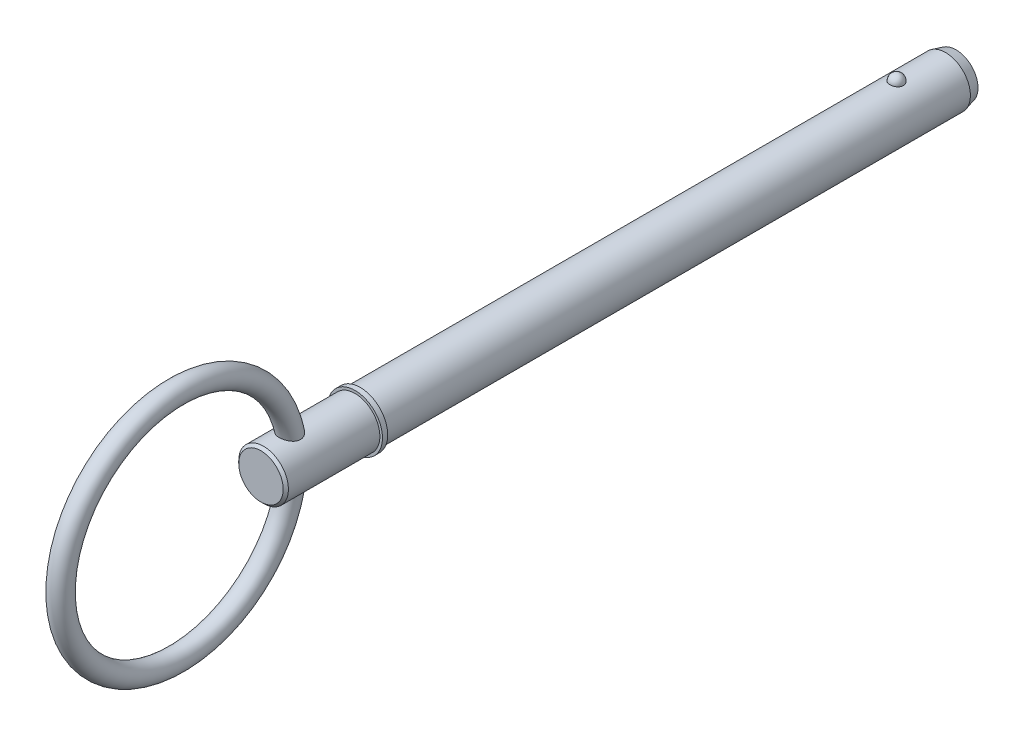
ISO-10303-21;
HEADER;
FILE_DESCRIPTION(('STEP AP214'),'2;1');
FILE_NAME('part.step','',(''),(''),'','','');
FILE_SCHEMA(('AUTOMOTIVE_DESIGN { 1 0 10303 214 1 1 1 1 }'));
ENDSEC;
DATA;
#1=APPLICATION_CONTEXT('core data for automotive mechanical design processes');
#2=APPLICATION_PROTOCOL_DEFINITION('international standard','automotive_design',2000,#1);
#3=PRODUCT_CONTEXT('',#1,'mechanical');
#4=PRODUCT('Part','Part','',(#3));
#5=PRODUCT_RELATED_PRODUCT_CATEGORY('part','',(#4));
#6=PRODUCT_DEFINITION_FORMATION('','',#4);
#7=PRODUCT_DEFINITION_CONTEXT('part definition',#1,'design');
#8=PRODUCT_DEFINITION('design','',#6,#7);
#9=PRODUCT_DEFINITION_SHAPE('','',#8);
#10=(LENGTH_UNIT() NAMED_UNIT(*) SI_UNIT(.MILLI.,.METRE.));
#11=(NAMED_UNIT(*) PLANE_ANGLE_UNIT() SI_UNIT($,.RADIAN.));
#12=(NAMED_UNIT(*) SI_UNIT($,.STERADIAN.) SOLID_ANGLE_UNIT());
#13=UNCERTAINTY_MEASURE_WITH_UNIT(LENGTH_MEASURE(1.E-05),#10,'distance_accuracy_value','');
#14=(GEOMETRIC_REPRESENTATION_CONTEXT(3) GLOBAL_UNCERTAINTY_ASSIGNED_CONTEXT((#13)) GLOBAL_UNIT_ASSIGNED_CONTEXT((#10,
#11,#12)) REPRESENTATION_CONTEXT('',''));
#15=CARTESIAN_POINT('',(0.,0.,0.));
#16=DIRECTION('',(0.,0.,1.));
#17=DIRECTION('',(1.,0.,0.));
#18=AXIS2_PLACEMENT_3D('',#15,#16,#17);
#19=CARTESIAN_POINT('',(0.,0.,101.6));
#20=DIRECTION('',(0.,0.,-1.));
#21=DIRECTION('',(-1.,0.,0.));
#22=AXIS2_PLACEMENT_3D('',#19,#20,#21);
#23=CYLINDRICAL_SURFACE('',#22,4.765);
#24=CARTESIAN_POINT('',(1.27812710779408,4.59038300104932,-1.29));
#25=CARTESIAN_POINT('',(1.27812572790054,4.59038414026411,-1.2178688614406));
#26=CARTESIAN_POINT('',(1.27223018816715,4.59203736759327,-1.14572000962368));
#27=CARTESIAN_POINT('',(1.24878929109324,4.59846646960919,-1.00346315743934));
#28=CARTESIAN_POINT('',(1.23123896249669,4.60324367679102,-0.933356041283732));
#29=CARTESIAN_POINT('',(1.18493861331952,4.61537801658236,-0.797215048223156));
#30=CARTESIAN_POINT('',(1.15619354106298,4.62273400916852,-0.731179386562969));
#31=CARTESIAN_POINT('',(1.08822596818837,4.6392032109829,-0.604986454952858));
#32=CARTESIAN_POINT('',(1.04900384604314,4.64831635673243,-0.544828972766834));
#33=CARTESIAN_POINT('',(0.960865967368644,4.66733302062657,-0.431775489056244));
#34=CARTESIAN_POINT('',(0.911906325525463,4.67723999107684,-0.378914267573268));
#35=CARTESIAN_POINT('',(0.805678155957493,4.69670280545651,-0.282245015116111));
#36=CARTESIAN_POINT('',(0.748409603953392,4.70625864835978,-0.238437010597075));
#37=CARTESIAN_POINT('',(0.627266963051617,4.72392767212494,-0.161207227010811));
#38=CARTESIAN_POINT('',(0.563411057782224,4.73204466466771,-0.127757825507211));
#39=CARTESIAN_POINT('',(0.430755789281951,4.74595788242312,-0.0720471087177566));
#40=CARTESIAN_POINT('',(0.361956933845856,4.75175434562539,-0.0497846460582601));
#41=CARTESIAN_POINT('',(0.222605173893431,4.76030056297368,-0.0173750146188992));
#42=CARTESIAN_POINT('',(0.152101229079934,4.76309991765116,-0.00703038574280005));
#43=CARTESIAN_POINT('',(0.0103009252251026,4.76551622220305,0.00191361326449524));
#44=CARTESIAN_POINT('',(-0.0609953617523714,4.76513345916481,0.000514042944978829));
#45=CARTESIAN_POINT('',(-0.201348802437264,4.76125496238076,-0.0138891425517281));
#46=CARTESIAN_POINT('',(-0.270423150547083,4.75780093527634,-0.0267372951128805));
#47=CARTESIAN_POINT('',(-0.405377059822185,4.74820737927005,-0.0634598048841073));
#48=CARTESIAN_POINT('',(-0.471256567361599,4.74206780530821,-0.0873343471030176));
#49=CARTESIAN_POINT('',(-0.598375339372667,4.72771507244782,-0.145611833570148));
#50=CARTESIAN_POINT('',(-0.659587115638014,4.71949070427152,-0.180071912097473));
#51=CARTESIAN_POINT('',(-0.775356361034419,4.70185936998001,-0.258542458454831));
#52=CARTESIAN_POINT('',(-0.8299131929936,4.69245229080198,-0.302553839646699));
#53=CARTESIAN_POINT('',(-0.931895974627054,4.67327936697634,-0.399829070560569));
#54=CARTESIAN_POINT('',(-0.979176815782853,4.66351011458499,-0.453244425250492));
#55=CARTESIAN_POINT('',(-1.06421220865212,4.64484426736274,-0.567321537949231));
#56=CARTESIAN_POINT('',(-1.10196613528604,4.63594772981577,-0.627983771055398));
#57=CARTESIAN_POINT('',(-1.16735225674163,4.61992036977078,-0.755585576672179));
#58=CARTESIAN_POINT('',(-1.19487251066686,4.61280933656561,-0.822585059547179));
#59=CARTESIAN_POINT('',(-1.23851975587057,4.60128324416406,-0.960417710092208));
#60=CARTESIAN_POINT('',(-1.25464705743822,4.59686811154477,-1.03125077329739));
#61=CARTESIAN_POINT('',(-1.27505790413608,4.59124882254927,-1.17443804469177));
#62=CARTESIAN_POINT('',(-1.27938868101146,4.59003186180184,-1.24678501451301));
#63=CARTESIAN_POINT('',(-1.27623192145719,4.5909105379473,-1.3911989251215));
#64=CARTESIAN_POINT('',(-1.26874468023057,4.59300609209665,-1.46326587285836));
#65=CARTESIAN_POINT('',(-1.24220427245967,4.60025423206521,-1.60473192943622));
#66=CARTESIAN_POINT('',(-1.2232043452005,4.60539274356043,-1.67414176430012));
#67=CARTESIAN_POINT('',(-1.17415910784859,4.61813957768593,-1.80870154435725));
#68=CARTESIAN_POINT('',(-1.1441133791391,4.62574799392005,-1.87385132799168));
#69=CARTESIAN_POINT('',(-1.07354327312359,4.64263368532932,-1.99841604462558));
#70=CARTESIAN_POINT('',(-1.03296580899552,4.65191934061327,-2.05779976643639));
#71=CARTESIAN_POINT('',(-0.942433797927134,4.67110036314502,-2.16881966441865));
#72=CARTESIAN_POINT('',(-0.892478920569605,4.68099575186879,-2.22045556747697));
#73=CARTESIAN_POINT('',(-0.784302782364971,4.70033161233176,-2.31471696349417));
#74=CARTESIAN_POINT('',(-0.726054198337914,4.70977043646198,-2.35731146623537));
#75=CARTESIAN_POINT('',(-0.602997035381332,4.72709995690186,-2.43206620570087));
#76=CARTESIAN_POINT('',(-0.538188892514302,4.73499075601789,-2.46422713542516));
#77=CARTESIAN_POINT('',(-0.404639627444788,4.7482563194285,-2.51687454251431));
#78=CARTESIAN_POINT('',(-0.335953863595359,4.7536596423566,-2.53749415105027));
#79=CARTESIAN_POINT('',(-0.195948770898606,4.76148510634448,-2.56703727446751));
#80=CARTESIAN_POINT('',(-0.124629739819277,4.76390758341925,-2.57596210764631));
#81=CARTESIAN_POINT('',(0.0172696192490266,4.76548774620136,-2.58180339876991));
#82=CARTESIAN_POINT('',(0.0878407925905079,4.76470225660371,-2.57892886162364));
#83=CARTESIAN_POINT('',(0.227467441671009,4.76008019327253,-2.56172603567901));
#84=CARTESIAN_POINT('',(0.296522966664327,4.75624371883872,-2.54739811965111));
#85=CARTESIAN_POINT('',(0.430942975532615,4.74595041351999,-2.50776251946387));
#86=CARTESIAN_POINT('',(0.496319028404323,4.7395023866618,-2.4824917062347));
#87=CARTESIAN_POINT('',(0.621860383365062,4.72467083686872,-2.4216730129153));
#88=CARTESIAN_POINT('',(0.682025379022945,4.71628720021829,-2.38612452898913));
#89=CARTESIAN_POINT('',(0.796409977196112,4.69833598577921,-2.30511163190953));
#90=CARTESIAN_POINT('',(0.850529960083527,4.68875291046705,-2.25951003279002));
#91=CARTESIAN_POINT('',(0.950412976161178,4.66953243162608,-2.15992428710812));
#92=CARTESIAN_POINT('',(0.996174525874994,4.65989501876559,-2.10593865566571));
#93=CARTESIAN_POINT('',(1.07885962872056,4.64145616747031,-1.99009376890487));
#94=CARTESIAN_POINT('',(1.11562789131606,4.63267081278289,-1.92812106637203));
#95=CARTESIAN_POINT('',(1.17840570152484,4.61710269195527,-1.79873681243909));
#96=CARTESIAN_POINT('',(1.20441973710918,4.61031909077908,-1.73132754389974));
#97=CARTESIAN_POINT('',(1.24242116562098,4.60021170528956,-1.60192906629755));
#98=CARTESIAN_POINT('',(1.25578772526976,4.59655387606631,-1.54036674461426));
#99=CARTESIAN_POINT('',(1.27364121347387,4.59163904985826,-1.41587409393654));
#100=CARTESIAN_POINT('',(1.2781283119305,4.59038200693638,-1.35294379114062));
#101=CARTESIAN_POINT('',(1.27812710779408,4.59038300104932,-1.29));
#102=B_SPLINE_CURVE_WITH_KNOTS('',3,(#24,#25,#26,#27,#28,#29,#30,#31,#32,#33,#34,#35,#36,#37,
#38,#39,#40,#41,#42,#43,#44,#45,#46,#47,#48,#49,#50,#51,#52,#53,#54,#55,#56,#57,#58,#59,#60,#61,
#62,#63,#64,#65,#66,#67,#68,#69,#70,#71,#72,#73,#74,#75,#76,#77,#78,#79,#80,#81,#82,#83,#84,#85,
#86,#87,#88,#89,#90,#91,#92,#93,#94,#95,#96,#97,#98,#99,#100,#101),.UNSPECIFIED.,.T.,.F.,(4,2,2,
2,2,2,2,2,2,2,2,2,2,2,2,2,2,2,2,2,2,2,2,2,2,2,2,2,2,2,2,2,2,2,2,2,2,2,4),(0.,0.216167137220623,
0.432426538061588,0.648590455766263,0.864746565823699,1.0818998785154,1.29905382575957,
1.51562361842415,1.73217119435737,1.94507683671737,2.15796327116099,2.36800220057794,
2.57804465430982,2.78924132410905,3.00045819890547,3.21545551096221,3.43046692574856,
3.64776550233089,3.8650581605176,4.08147951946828,4.29789547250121,4.51331818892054,
4.72874907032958,4.94528769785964,5.16183395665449,5.37911087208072,5.59637335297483,
5.8110751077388,6.02575265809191,6.23664413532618,6.44752874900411,6.65770827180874,
6.86790014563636,7.08116060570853,7.29445887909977,7.51121476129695,7.72788009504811,
7.91651762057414,8.10515153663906),.UNSPECIFIED.);
#103=CARTESIAN_POINT('',(1.27812710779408,4.59038300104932,-1.29));
#104=VERTEX_POINT('',#103);
#105=EDGE_CURVE('E100',#104,#104,#102,.T.);
#106=ORIENTED_EDGE('',*,*,#105,.T.);
#107=EDGE_LOOP('',(#106));
#108=FACE_BOUND('',#107,.T.);
#109=CARTESIAN_POINT('',(0.,0.,-10.7));
#110=DIRECTION('',(0.,0.,-1.));
#111=DIRECTION('',(-1.,0.,0.));
#112=AXIS2_PLACEMENT_3D('',#109,#110,#111);
#113=CIRCLE('',#112,4.765);
#114=CARTESIAN_POINT('',(-4.765,0.,-10.7));
#115=VERTEX_POINT('',#114);
#116=EDGE_CURVE('E107',#115,#115,#113,.F.);
#117=ORIENTED_EDGE('',*,*,#116,.T.);
#118=EDGE_LOOP('',(#117));
#119=FACE_BOUND('',#118,.T.);
#120=CARTESIAN_POINT('',(0.,0.,101.6));
#121=DIRECTION('',(0.,0.,1.));
#122=DIRECTION('',(1.,0.,0.));
#123=AXIS2_PLACEMENT_3D('',#120,#121,#122);
#124=CIRCLE('',#123,4.765);
#125=CARTESIAN_POINT('',(4.765,0.,101.6));
#126=VERTEX_POINT('',#125);
#127=EDGE_CURVE('E105',#126,#126,#124,.T.);
#128=ORIENTED_EDGE('',*,*,#127,.F.);
#129=EDGE_LOOP('',(#128));
#130=FACE_BOUND('',#129,.T.);
#131=ADVANCED_FACE('F39',(#108,#119,#130),#23,.T.);
#132=CARTESIAN_POINT('',(0.,0.,-12.7));
#133=DIRECTION('',(0.,0.,-1.));
#134=DIRECTION('',(-1.,0.,0.));
#135=AXIS2_PLACEMENT_3D('',#132,#133,#134);
#136=PLANE('',#135);
#137=CARTESIAN_POINT('',(0.,0.,-12.7));
#138=DIRECTION('',(0.,0.,-1.));
#139=DIRECTION('',(-1.,0.,0.));
#140=AXIS2_PLACEMENT_3D('',#137,#138,#139);
#141=CIRCLE('',#140,4.22910161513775);
#142=CARTESIAN_POINT('',(-4.22910161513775,0.,-12.7));
#143=VERTEX_POINT('',#142);
#144=EDGE_CURVE('E140',#143,#143,#141,.T.);
#145=ORIENTED_EDGE('',*,*,#144,.T.);
#146=EDGE_LOOP('',(#145));
#147=FACE_BOUND('',#146,.T.);
#148=ADVANCED_FACE('F86',(#147),#136,.T.);
#149=CARTESIAN_POINT('',(0.,0.,-12.7));
#150=DIRECTION('',(0.,0.,1.));
#151=DIRECTION('',(1.,0.,0.));
#152=AXIS2_PLACEMENT_3D('',#149,#150,#151);
#153=CONICAL_SURFACE('',#152,4.22910161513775,0.261799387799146);
#154=ORIENTED_EDGE('',*,*,#116,.F.);
#155=EDGE_LOOP('',(#154));
#156=FACE_BOUND('',#155,.T.);
#157=ORIENTED_EDGE('',*,*,#144,.F.);
#158=EDGE_LOOP('',(#157));
#159=FACE_BOUND('',#158,.T.);
#160=ADVANCED_FACE('F92',(#156,#159),#153,.T.);
#161=CARTESIAN_POINT('',(0.,4.765,-1.29));
#162=DIRECTION('',(0.,1.,0.));
#163=DIRECTION('',(0.,0.,-1.));
#164=AXIS2_PLACEMENT_3D('',#161,#162,#163);
#165=SPHERICAL_SURFACE('',#164,1.29);
#166=ORIENTED_EDGE('',*,*,#105,.F.);
#167=EDGE_LOOP('',(#166));
#168=FACE_BOUND('',#167,.T.);
#169=ADVANCED_FACE('F110',(#168),#165,.T.);
#170=CARTESIAN_POINT('',(0.,0.,101.6));
#171=DIRECTION('',(0.,0.,-1.));
#172=DIRECTION('',(-1.,0.,0.));
#173=AXIS2_PLACEMENT_3D('',#170,#171,#172);
#174=PLANE('',#173);
#175=ORIENTED_EDGE('',*,*,#127,.T.);
#176=EDGE_LOOP('',(#175));
#177=FACE_BOUND('',#176,.T.);
#178=CARTESIAN_POINT('',(0.,0.,101.6));
#179=DIRECTION('',(0.,0.,-1.));
#180=DIRECTION('',(-1.,0.,0.));
#181=AXIS2_PLACEMENT_3D('',#178,#179,#180);
#182=CIRCLE('',#181,5.265);
#183=CARTESIAN_POINT('',(-5.265,0.,101.6));
#184=VERTEX_POINT('',#183);
#185=EDGE_CURVE('E106',#184,#184,#182,.T.);
#186=ORIENTED_EDGE('',*,*,#185,.T.);
#187=EDGE_LOOP('',(#186));
#188=FACE_BOUND('',#187,.T.);
#189=ADVANCED_FACE('F114',(#177,#188),#174,.T.);
#190=CARTESIAN_POINT('',(0.,0.,33.7287874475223));
#191=DIRECTION('',(0.,0.,-1.));
#192=DIRECTION('',(-1.,0.,0.));
#193=AXIS2_PLACEMENT_3D('',#190,#191,#192);
#194=CYLINDRICAL_SURFACE('',#193,5.265);
#195=CARTESIAN_POINT('',(0.,0.,102.6));
#196=DIRECTION('',(0.,0.,-1.));
#197=DIRECTION('',(-1.,0.,0.));
#198=AXIS2_PLACEMENT_3D('',#195,#196,#197);
#199=CIRCLE('',#198,5.265);
#200=CARTESIAN_POINT('',(-5.265,0.,102.6));
#201=VERTEX_POINT('',#200);
#202=EDGE_CURVE('E131',#201,#201,#199,.T.);
#203=ORIENTED_EDGE('',*,*,#202,.T.);
#204=EDGE_LOOP('',(#203));
#205=FACE_BOUND('',#204,.T.);
#206=ORIENTED_EDGE('',*,*,#185,.F.);
#207=EDGE_LOOP('',(#206));
#208=FACE_BOUND('',#207,.T.);
#209=ADVANCED_FACE('F118',(#205,#208),#194,.T.);
#210=CARTESIAN_POINT('',(0.,5.265,102.6));
#211=DIRECTION('',(0.,0.,1.));
#212=DIRECTION('',(1.,0.,0.));
#213=AXIS2_PLACEMENT_3D('',#210,#211,#212);
#214=PLANE('',#213);
#215=CARTESIAN_POINT('',(0.,0.,102.6));
#216=DIRECTION('',(0.,0.,1.));
#217=DIRECTION('',(1.,0.,0.));
#218=AXIS2_PLACEMENT_3D('',#215,#216,#217);
#219=CIRCLE('',#218,4.765);
#220=CARTESIAN_POINT('',(4.765,0.,102.6));
#221=VERTEX_POINT('',#220);
#222=EDGE_CURVE('E109',#221,#221,#219,.T.);
#223=ORIENTED_EDGE('',*,*,#222,.F.);
#224=EDGE_LOOP('',(#223));
#225=FACE_BOUND('',#224,.T.);
#226=ORIENTED_EDGE('',*,*,#202,.F.);
#227=EDGE_LOOP('',(#226));
#228=FACE_BOUND('',#227,.T.);
#229=ADVANCED_FACE('F83',(#225,#228),#214,.T.);
#230=CARTESIAN_POINT('',(0.,0.,120.65));
#231=DIRECTION('',(0.,0.,-1.));
#232=DIRECTION('',(-1.,0.,0.));
#233=AXIS2_PLACEMENT_3D('',#230,#231,#232);
#234=CYLINDRICAL_SURFACE('',#233,4.765);
#235=CARTESIAN_POINT('',(-1.17603588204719,-4.61759294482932,113.48372006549));
#236=CARTESIAN_POINT('',(-1.08605054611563,-4.6405075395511,113.4215688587));
#237=CARTESIAN_POINT('',(-0.990486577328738,-4.66202408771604,113.36673933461));
#238=CARTESIAN_POINT('',(-0.790762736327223,-4.70002969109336,113.272995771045));
#239=CARTESIAN_POINT('',(-0.686587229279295,-4.7165093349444,113.234111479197));
#240=CARTESIAN_POINT('',(-0.472539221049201,-4.7427361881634,113.173267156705));
#241=CARTESIAN_POINT('',(-0.362665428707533,-4.75248186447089,113.151310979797));
#242=CARTESIAN_POINT('',(-0.140482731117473,-4.7642267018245,113.124936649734));
#243=CARTESIAN_POINT('',(-0.0281752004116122,-4.7662301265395,113.120508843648));
#244=CARTESIAN_POINT('',(0.193745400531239,-4.76233166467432,113.129208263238));
#245=CARTESIAN_POINT('',(0.303372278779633,-4.75656024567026,113.142045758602));
#246=CARTESIAN_POINT('',(0.518724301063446,-4.73791484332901,113.184434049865));
#247=CARTESIAN_POINT('',(0.624448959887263,-4.72503997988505,113.213986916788));
#248=CARTESIAN_POINT('',(0.829434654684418,-4.69340588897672,113.28920858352));
#249=CARTESIAN_POINT('',(0.928674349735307,-4.6746283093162,113.334927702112));
#250=CARTESIAN_POINT('',(1.11777413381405,-4.63305392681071,113.441473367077));
#251=CARTESIAN_POINT('',(1.20763216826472,-4.61025624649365,113.502303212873));
#252=CARTESIAN_POINT('',(1.37762760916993,-4.56238439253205,113.63943936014));
#253=CARTESIAN_POINT('',(1.45749020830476,-4.53726959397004,113.71607281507));
#254=CARTESIAN_POINT('',(1.60275140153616,-4.48801828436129,113.882293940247));
#255=CARTESIAN_POINT('',(1.66815155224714,-4.46388166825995,113.971880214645));
#256=CARTESIAN_POINT('',(1.78162069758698,-4.41980966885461,114.160468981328));
#257=CARTESIAN_POINT('',(1.82993675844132,-4.3998162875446,114.259308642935));
#258=CARTESIAN_POINT('',(1.90902953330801,-4.36608532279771,114.464739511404));
#259=CARTESIAN_POINT('',(1.93981696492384,-4.35234391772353,114.571325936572));
#260=CARTESIAN_POINT('',(1.9818112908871,-4.33337618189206,114.782380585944));
#261=CARTESIAN_POINT('',(1.99406945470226,-4.32769391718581,114.88660066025));
#262=CARTESIAN_POINT('',(2.0025484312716,-4.32377679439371,115.095812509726));
#263=CARTESIAN_POINT('',(1.99876733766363,-4.32554282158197,115.200804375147));
#264=CARTESIAN_POINT('',(1.97595504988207,-4.33600911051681,115.409105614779));
#265=CARTESIAN_POINT('',(1.95686739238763,-4.3447350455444,115.512407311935));
#266=CARTESIAN_POINT('',(1.90457346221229,-4.36790947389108,115.714679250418));
#267=CARTESIAN_POINT('',(1.87136191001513,-4.38236010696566,115.813647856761));
#268=CARTESIAN_POINT('',(1.78747856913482,-4.41728816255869,116.016470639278));
#269=CARTESIAN_POINT('',(1.73524632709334,-4.43826528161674,116.119592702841));
#270=CARTESIAN_POINT('',(1.61607256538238,-4.48303292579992,116.316386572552));
#271=CARTESIAN_POINT('',(1.5491157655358,-4.50682636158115,116.410048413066));
#272=CARTESIAN_POINT('',(1.39359064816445,-4.55746895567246,116.595383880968));
#273=CARTESIAN_POINT('',(1.30346928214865,-4.58437060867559,116.685750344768));
#274=CARTESIAN_POINT('',(1.10794390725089,-4.6354985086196,116.849011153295));
#275=CARTESIAN_POINT('',(1.00255934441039,-4.65972809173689,116.921927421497));
#276=CARTESIAN_POINT('',(0.803761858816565,-4.69755503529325,117.032407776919));
#277=CARTESIAN_POINT('',(0.712935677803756,-4.71231838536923,117.074230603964));
#278=CARTESIAN_POINT('',(0.525172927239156,-4.73691370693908,117.142936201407));
#279=CARTESIAN_POINT('',(0.428242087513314,-4.7467502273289,117.169832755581));
#280=CARTESIAN_POINT('',(0.230351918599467,-4.76046566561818,117.207147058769));
#281=CARTESIAN_POINT('',(0.129376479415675,-4.76431768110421,117.217490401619));
#282=CARTESIAN_POINT('',(-0.0728965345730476,-4.76551495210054,117.220716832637));
#283=CARTESIAN_POINT('',(-0.174194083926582,-4.76286070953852,117.21360126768));
#284=CARTESIAN_POINT('',(-0.366467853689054,-4.751792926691,117.183579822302));
#285=CARTESIAN_POINT('',(-0.457659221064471,-4.74381187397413,117.161858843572));
#286=CARTESIAN_POINT('',(-0.635226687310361,-4.72331548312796,117.105084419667));
#287=CARTESIAN_POINT('',(-0.721601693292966,-4.71079912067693,117.070027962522));
#288=CARTESIAN_POINT('',(-0.893212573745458,-4.68139468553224,116.985559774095));
#289=CARTESIAN_POINT('',(-0.978027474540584,-4.66427939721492,116.935377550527));
#290=CARTESIAN_POINT('',(-1.13917803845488,-4.62756330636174,116.823642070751));
#291=CARTESIAN_POINT('',(-1.21550961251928,-4.6079613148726,116.762083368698));
#292=CARTESIAN_POINT('',(-1.37033540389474,-4.56452178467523,116.61868852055));
#293=CARTESIAN_POINT('',(-1.44723650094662,-4.54050700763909,116.535184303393));
#294=CARTESIAN_POINT('',(-1.58763850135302,-4.49334232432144,116.357292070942));
#295=CARTESIAN_POINT('',(-1.65112672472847,-4.47019325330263,116.262893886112));
#296=CARTESIAN_POINT('',(-1.77033243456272,-4.42444393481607,116.053206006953));
#297=CARTESIAN_POINT('',(-1.82420433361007,-4.40224259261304,115.936768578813));
#298=CARTESIAN_POINT('',(-1.91169086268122,-4.36496831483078,115.695409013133));
#299=CARTESIAN_POINT('',(-1.94531523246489,-4.34989195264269,115.570490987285));
#300=CARTESIAN_POINT('',(-1.98892523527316,-4.33012255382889,115.322016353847));
#301=CARTESIAN_POINT('',(-1.99998275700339,-4.32495941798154,115.198689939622));
#302=CARTESIAN_POINT('',(-2.00001713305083,-4.32494814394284,114.952073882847));
#303=CARTESIAN_POINT('',(-1.98902141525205,-4.33008719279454,114.828784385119));
#304=CARTESIAN_POINT('',(-1.94752572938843,-4.34888267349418,114.60321378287));
#305=CARTESIAN_POINT('',(-1.9197975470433,-4.36132278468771,114.500310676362));
#306=CARTESIAN_POINT('',(-1.84805595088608,-4.39220107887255,114.301251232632));
#307=CARTESIAN_POINT('',(-1.80403476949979,-4.4106421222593,114.205098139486));
#308=CARTESIAN_POINT('',(-1.70232000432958,-4.45086896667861,114.024457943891));
#309=CARTESIAN_POINT('',(-1.64499853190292,-4.47255887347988,113.939738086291));
#310=CARTESIAN_POINT('',(-1.51770958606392,-4.51733419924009,113.781012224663));
#311=CARTESIAN_POINT('',(-1.44776268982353,-4.54041730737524,113.706989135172));
#312=CARTESIAN_POINT('',(-1.34143544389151,-4.57239833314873,113.61104340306));
#313=CARTESIAN_POINT('',(-1.30955259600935,-4.58164274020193,113.584115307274));
#314=CARTESIAN_POINT('',(-1.24406394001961,-4.59985727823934,113.532340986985));
#315=CARTESIAN_POINT('',(-1.21045807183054,-4.6088273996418,113.50749483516));
#316=CARTESIAN_POINT('',(-1.17603588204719,-4.61759294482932,113.48372006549));
#317=B_SPLINE_CURVE_WITH_KNOTS('',3,(#235,#236,#237,#238,#239,#240,#241,#242,#243,#244,#245,
#246,#247,#248,#249,#250,#251,#252,#253,#254,#255,#256,#257,#258,#259,#260,#261,#262,#263,#264,
#265,#266,#267,#268,#269,#270,#271,#272,#273,#274,#275,#276,#277,#278,#279,#280,#281,#282,#283,
#284,#285,#286,#287,#288,#289,#290,#291,#292,#293,#294,#295,#296,#297,#298,#299,#300,#301,#302,
#303,#304,#305,#306,#307,#308,#309,#310,#311,#312,#313,#314,#315,#316),.UNSPECIFIED.,.T.,.F.,(4,
2,2,2,2,2,2,2,2,2,2,2,2,2,2,2,2,2,2,2,2,2,2,2,2,2,2,2,2,2,2,2,2,2,2,2,2,2,2,2,4),(0.,
0.335054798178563,0.67073186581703,1.00648532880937,1.34205386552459,1.67206089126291,
2.00210881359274,2.33319321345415,2.66434996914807,3.00321157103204,3.34203668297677,
3.67573940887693,4.00923787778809,4.32299322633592,4.63678586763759,4.95174139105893,
5.26681474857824,5.61785759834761,5.96926647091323,6.35862694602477,6.74749565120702,
7.04947204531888,7.35116911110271,7.6542185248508,7.9572445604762,8.23825252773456,
8.51932400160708,8.81825171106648,9.11732288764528,9.46404422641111,9.811091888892,
10.1997682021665,10.5882573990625,10.9578189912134,11.3269212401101,11.6472091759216,
11.9676500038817,12.2800235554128,12.5918925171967,12.7200569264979,12.8482258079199),.UNSPECIFIED.);
#318=CARTESIAN_POINT('',(-1.17603588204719,-4.61759294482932,113.48372006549));
#319=VERTEX_POINT('',#318);
#320=EDGE_CURVE('E10',#319,#319,#317,.T.);
#321=ORIENTED_EDGE('',*,*,#320,.F.);
#322=EDGE_LOOP('',(#321));
#323=FACE_BOUND('',#322,.T.);
#324=CARTESIAN_POINT('',(-1.17603588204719,4.61759294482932,113.48372006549));
#325=CARTESIAN_POINT('',(-1.26499234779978,4.59493450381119,113.545169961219));
#326=CARTESIAN_POINT('',(-1.34870034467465,4.57085993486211,113.613915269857));
#327=CARTESIAN_POINT('',(-1.50334626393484,4.52236448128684,113.764635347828));
#328=CARTESIAN_POINT('',(-1.57425996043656,4.49794303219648,113.84663466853));
#329=CARTESIAN_POINT('',(-1.7013018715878,4.45144771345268,114.022234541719));
#330=CARTESIAN_POINT('',(-1.75740699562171,4.42937754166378,114.11585288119));
#331=CARTESIAN_POINT('',(-1.85287755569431,4.3903018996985,114.3121668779));
#332=CARTESIAN_POINT('',(-1.89225871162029,4.37329167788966,114.414853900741));
#333=CARTESIAN_POINT('',(-1.95188661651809,4.34699775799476,114.621857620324));
#334=CARTESIAN_POINT('',(-1.97286468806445,4.33742068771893,114.725926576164));
#335=CARTESIAN_POINT('',(-1.99814509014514,4.32583397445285,114.936471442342));
#336=CARTESIAN_POINT('',(-2.00244696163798,4.32382453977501,115.042947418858));
#337=CARTESIAN_POINT('',(-1.99499900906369,4.32726361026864,115.252770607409));
#338=CARTESIAN_POINT('',(-1.9836061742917,4.33254625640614,115.356134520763));
#339=CARTESIAN_POINT('',(-1.94643618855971,4.34936983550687,115.559691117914));
#340=CARTESIAN_POINT('',(-1.92065444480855,4.3609127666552,115.659882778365));
#341=CARTESIAN_POINT('',(-1.85292379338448,4.3901452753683,115.86410420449));
#342=CARTESIAN_POINT('',(-1.80971134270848,4.40830066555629,115.967646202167));
#343=CARTESIAN_POINT('',(-1.70892742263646,4.44833985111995,116.166768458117));
#344=CARTESIAN_POINT('',(-1.65134284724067,4.47022704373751,116.262341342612));
#345=CARTESIAN_POINT('',(-1.51475300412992,4.51847764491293,116.455260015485));
#346=CARTESIAN_POINT('',(-1.43395667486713,4.54505660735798,116.551291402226));
#347=CARTESIAN_POINT('',(-1.25684082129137,4.59718102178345,116.728132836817));
#348=CARTESIAN_POINT('',(-1.16053129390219,4.62272712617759,116.808952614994));
#349=CARTESIAN_POINT('',(-0.972192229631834,4.66558476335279,116.939326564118));
#350=CARTESIAN_POINT('',(-0.882391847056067,4.68355428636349,116.991879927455));
#351=CARTESIAN_POINT('',(-0.69483616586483,4.71502283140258,117.082022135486));
#352=CARTESIAN_POINT('',(-0.597087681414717,4.72852563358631,117.119623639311));
#353=CARTESIAN_POINT('',(-0.395321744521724,4.74966109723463,117.177875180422));
#354=CARTESIAN_POINT('',(-0.29126929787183,4.7572569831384,117.198419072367));
#355=CARTESIAN_POINT('',(-0.0808979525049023,4.76547327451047,117.220624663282));
#356=CARTESIAN_POINT('',(0.0254198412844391,4.76609700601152,117.22229536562));
#357=CARTESIAN_POINT('',(0.225327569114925,4.7606097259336,117.207485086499));
#358=CARTESIAN_POINT('',(0.319084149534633,4.75519734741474,117.192887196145));
#359=CARTESIAN_POINT('',(0.502750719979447,4.73930039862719,117.149397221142));
#360=CARTESIAN_POINT('',(0.592660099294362,4.7288150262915,117.120502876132));
#361=CARTESIAN_POINT('',(0.768777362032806,4.70343779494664,117.04904136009));
#362=CARTESIAN_POINT('',(0.854839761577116,4.68844387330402,117.006155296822));
#363=CARTESIAN_POINT('',(1.01943666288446,4.65543047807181,116.908746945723));
#364=CARTESIAN_POINT('',(1.09796821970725,4.63740982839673,116.854220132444));
#365=CARTESIAN_POINT('',(1.25751825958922,4.59691257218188,116.726465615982));
#366=CARTESIAN_POINT('',(1.33721103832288,4.57417011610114,116.651667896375));
#367=CARTESIAN_POINT('',(1.48461190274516,4.52847869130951,116.491082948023));
#368=CARTESIAN_POINT('',(1.55230949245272,4.50552956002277,116.405286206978));
#369=CARTESIAN_POINT('',(1.68366050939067,4.45825797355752,116.211404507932));
#370=CARTESIAN_POINT('',(1.74532014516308,4.43421533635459,116.101889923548));
#371=CARTESIAN_POINT('',(1.85007805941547,4.39154308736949,115.873269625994));
#372=CARTESIAN_POINT('',(1.89317429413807,4.37291407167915,115.754162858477));
#373=CARTESIAN_POINT('',(1.958572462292,4.34402041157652,115.509763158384));
#374=CARTESIAN_POINT('',(1.98095022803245,4.33372528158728,115.384494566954));
#375=CARTESIAN_POINT('',(2.00301292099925,4.32358016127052,115.131594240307));
#376=CARTESIAN_POINT('',(2.00273000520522,4.32371536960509,115.003966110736));
#377=CARTESIAN_POINT('',(1.97997568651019,4.3341693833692,114.768247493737));
#378=CARTESIAN_POINT('',(1.96044562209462,4.34313814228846,114.659806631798));
#379=CARTESIAN_POINT('',(1.903681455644,4.3683153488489,114.448543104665));
#380=CARTESIAN_POINT('',(1.86644884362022,4.38452318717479,114.345719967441));
#381=CARTESIAN_POINT('',(1.7781154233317,4.42104679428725,114.15471002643));
#382=CARTESIAN_POINT('',(1.72797707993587,4.44105894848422,114.066015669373));
#383=CARTESIAN_POINT('',(1.61439500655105,4.48359504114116,113.898286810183));
#384=CARTESIAN_POINT('',(1.55094927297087,4.50611935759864,113.819253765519));
#385=CARTESIAN_POINT('',(1.40889349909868,4.55259151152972,113.668705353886));
#386=CARTESIAN_POINT('',(1.32968750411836,4.57655455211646,113.597757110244));
#387=CARTESIAN_POINT('',(1.16035884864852,4.62238936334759,113.469506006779));
#388=CARTESIAN_POINT('',(1.07023361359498,4.64426063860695,113.41220637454));
#389=CARTESIAN_POINT('',(0.877362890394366,4.68460759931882,113.310316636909));
#390=CARTESIAN_POINT('',(0.774249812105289,4.70290564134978,113.266349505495));
#391=CARTESIAN_POINT('',(0.561430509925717,4.73302876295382,113.195484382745));
#392=CARTESIAN_POINT('',(0.451725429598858,4.74485496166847,113.168583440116));
#393=CARTESIAN_POINT('',(0.230282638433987,4.76071009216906,113.132763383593));
#394=CARTESIAN_POINT('',(0.11858761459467,4.76483485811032,113.123623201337));
#395=CARTESIAN_POINT('',(-0.104911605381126,4.76515532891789,113.122908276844));
#396=CARTESIAN_POINT('',(-0.216715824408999,4.76134861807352,113.131338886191));
#397=CARTESIAN_POINT('',(-0.435231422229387,4.74632552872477,113.16524563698));
#398=CARTESIAN_POINT('',(-0.541996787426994,4.73523460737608,113.190433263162));
#399=CARTESIAN_POINT('',(-0.749371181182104,4.70686626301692,113.256921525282));
#400=CARTESIAN_POINT('',(-0.849990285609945,4.68959930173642,113.298194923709));
#401=CARTESIAN_POINT('',(-0.986108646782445,4.6620261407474,113.367235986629));
#402=CARTESIAN_POINT('',(-1.0252576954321,4.65355983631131,113.388772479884));
#403=CARTESIAN_POINT('',(-1.10191286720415,4.63600664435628,113.434367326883));
#404=CARTESIAN_POINT('',(-1.13941901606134,4.62691976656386,113.458425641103));
#405=CARTESIAN_POINT('',(-1.17603588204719,4.61759294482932,113.48372006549));
#406=B_SPLINE_CURVE_WITH_KNOTS('',3,(#324,#325,#326,#327,#328,#329,#330,#331,#332,#333,#334,
#335,#336,#337,#338,#339,#340,#341,#342,#343,#344,#345,#346,#347,#348,#349,#350,#351,#352,#353,
#354,#355,#356,#357,#358,#359,#360,#361,#362,#363,#364,#365,#366,#367,#368,#369,#370,#371,#372,
#373,#374,#375,#376,#377,#378,#379,#380,#381,#382,#383,#384,#385,#386,#387,#388,#389,#390,#391,
#392,#393,#394,#395,#396,#397,#398,#399,#400,#401,#402,#403,#404,#405),.UNSPECIFIED.,.T.,.F.,(4,
2,2,2,2,2,2,2,2,2,2,2,2,2,2,2,2,2,2,2,2,2,2,2,2,2,2,2,2,2,2,2,2,2,2,2,2,2,2,2,4),(0.,
0.331234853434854,0.663090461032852,0.995460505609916,1.3275174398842,1.64568783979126,
1.96386699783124,2.27492717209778,2.58608669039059,2.92571998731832,3.26566413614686,
3.64875195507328,4.0315938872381,4.34706664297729,4.66227172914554,4.97942386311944,
5.29642469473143,5.58021908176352,5.86405835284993,6.15488068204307,6.44581627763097,
6.77943874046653,7.11335170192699,7.49545660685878,7.87760356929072,8.25834622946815,
8.63854860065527,8.96843568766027,9.29829501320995,9.60842872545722,9.91860916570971,
10.2441707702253,10.5698092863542,10.9089029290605,11.2479379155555,11.5827251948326,
11.9176144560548,12.2468820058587,12.5755944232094,12.7119417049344,12.8482868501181),.UNSPECIFIED.);
#407=CARTESIAN_POINT('',(-1.17603588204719,4.61759294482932,113.48372006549));
#408=VERTEX_POINT('',#407);
#409=EDGE_CURVE('E51',#408,#408,#406,.T.);
#410=ORIENTED_EDGE('',*,*,#409,.F.);
#411=EDGE_LOOP('',(#410));
#412=FACE_BOUND('',#411,.T.);
#413=CARTESIAN_POINT('',(0.,0.,120.15));
#414=DIRECTION('',(0.,0.,-1.));
#415=DIRECTION('',(-1.,0.,0.));
#416=AXIS2_PLACEMENT_3D('',#413,#414,#415);
#417=CIRCLE('',#416,4.765);
#418=CARTESIAN_POINT('',(-4.765,0.,120.15));
#419=VERTEX_POINT('',#418);
#420=EDGE_CURVE('E62',#419,#419,#417,.T.);
#421=ORIENTED_EDGE('',*,*,#420,.T.);
#422=EDGE_LOOP('',(#421));
#423=FACE_BOUND('',#422,.T.);
#424=ORIENTED_EDGE('',*,*,#222,.T.);
#425=EDGE_LOOP('',(#424));
#426=FACE_BOUND('',#425,.T.);
#427=ADVANCED_FACE('F67',(#323,#412,#423,#426),#234,.T.);
#428=CARTESIAN_POINT('',(0.,0.,120.65));
#429=DIRECTION('',(0.,0.,-1.));
#430=DIRECTION('',(-1.,0.,0.));
#431=AXIS2_PLACEMENT_3D('',#428,#429,#430);
#432=PLANE('',#431);
#433=CARTESIAN_POINT('',(0.,0.,120.65));
#434=DIRECTION('',(0.,0.,-1.));
#435=DIRECTION('',(-1.,0.,0.));
#436=AXIS2_PLACEMENT_3D('',#433,#434,#435);
#437=CIRCLE('',#436,4.26499999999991);
#438=CARTESIAN_POINT('',(-4.26499999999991,0.,120.65));
#439=VERTEX_POINT('',#438);
#440=EDGE_CURVE('E57',#439,#439,#437,.F.);
#441=ORIENTED_EDGE('',*,*,#440,.T.);
#442=EDGE_LOOP('',(#441));
#443=FACE_BOUND('',#442,.T.);
#444=ADVANCED_FACE('F74',(#443),#432,.F.);
#445=CARTESIAN_POINT('',(0.,0.,120.15));
#446=DIRECTION('',(0.,0.,-1.));
#447=DIRECTION('',(-1.,0.,0.));
#448=AXIS2_PLACEMENT_3D('',#445,#446,#447);
#449=CONICAL_SURFACE('',#448,4.765,0.785398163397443);
#450=ORIENTED_EDGE('',*,*,#440,.F.);
#451=EDGE_LOOP('',(#450));
#452=FACE_BOUND('',#451,.T.);
#453=ORIENTED_EDGE('',*,*,#420,.F.);
#454=EDGE_LOOP('',(#453));
#455=FACE_BOUND('',#454,.T.);
#456=ADVANCED_FACE('F41',(#452,#455),#449,.T.);
#457=CARTESIAN_POINT('',(0.,0.,136.875));
#458=DIRECTION('',(1.,0.,0.));
#459=DIRECTION('',(0.,0.,-1.));
#460=AXIS2_PLACEMENT_3D('',#457,#458,#459);
#461=TOROIDAL_SURFACE('',#460,22.225,2.);
#462=ORIENTED_EDGE('',*,*,#320,.T.);
#463=EDGE_LOOP('',(#462));
#464=FACE_BOUND('',#463,.T.);
#465=ORIENTED_EDGE('',*,*,#409,.T.);
#466=EDGE_LOOP('',(#465));
#467=FACE_BOUND('',#466,.T.);
#468=ADVANCED_FACE('F71',(#464,#467),#461,.T.);
#469=CLOSED_SHELL('',(#131,#148,#160,#169,#189,#209,#229,#427,#444,#456,#468));
#470=MANIFOLD_SOLID_BREP('B2',#469);
#471=ADVANCED_BREP_SHAPE_REPRESENTATION('',(#18,#470),#14);
#472=SHAPE_DEFINITION_REPRESENTATION(#9,#471);
ENDSEC;
END-ISO-10303-21;
